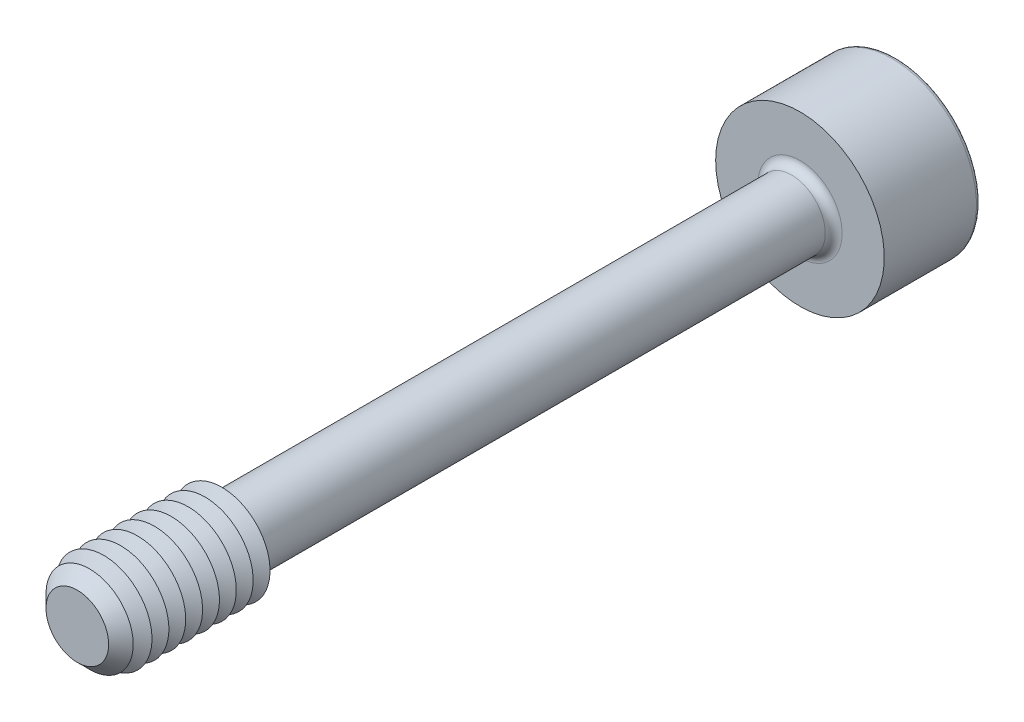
from build123d import *

# Parameters (mm, degrees)
SKETCH1_R       = 1.4
EXTRUDE1_DEPTH  = 15
CHAMFER1_SIZE   = 0.7
SKETCH3_R       = 3.5
EXTRUDE2_DEPTH  = 4
EXTRUDE3_DEPTH  = 3
FILLET1_R       = 0.35
FILLET2_R       = 0.175
LPATTERN1_COUNT = 8
LPATTERN1_PITCH = 0.7


with BuildPart() as part:
    # Sketch1 → Extrude1 (new, symmetric)
    with BuildSketch(Plane.XY):
        Circle(SKETCH1_R)
    extrude(amount=EXTRUDE1_DEPTH, both=True)

    # Sketch2 → Revolve1 (revolve)
    with BuildSketch(Plane(origin=(0, 0, 0), x_dir=(0, 0, -1), z_dir=(1, 0, 0))):
        Polygon((-15, 0), (-15, 2), (-9, 2), (-8.653589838, 1.4), (-8.653589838, 0), align=None)
    revolve(axis=Axis((0, 0, 8.653589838), (0, 0, 1)))

    # Chamfer1
    chamfer1_edges = [part.edges().sort_by_distance(p)[0] for p in [
        (0, -2, 15),
    ]]
    chamfer(chamfer1_edges, length=CHAMFER1_SIZE)

    # Sketch3 → Extrude2 (add)
    with BuildSketch(Plane(origin=(0, 0, -15), x_dir=(-1, 0, 0), z_dir=(0, 0, -1))):
        Circle(SKETCH3_R)
    extrude(amount=EXTRUDE2_DEPTH)

    # Sketch4 → Extrude3 (cut)
    with BuildSketch(Plane(origin=(-13.7, 0, -19), x_dir=(1, 0, 0), z_dir=(0, 0, 1))):
        Polygon((12.833974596, -1.5), (14.566025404, -1.5), (15.432050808, 0), (14.566025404, 1.5), (12.833974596, 1.5), (11.967949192, 0), align=None)
    extrude(amount=EXTRUDE3_DEPTH, mode=Mode.SUBTRACT)

    # Fillet1
    fillet1_edges = [part.edges().sort_by_distance(p)[0] for p in [
        (-1.4, 0, -15),
    ]]
    fillet(fillet1_edges, radius=FILLET1_R)

    # Fillet2
    fillet2_edges = [part.edges().sort_by_distance(p)[0] for p in [
        (3.5, 0, -19),
    ]]
    fillet(fillet2_edges, radius=FILLET2_R)

    # Sketch5 → Cut-Revolve1 (revolve, cut)
    with BuildSketch(Plane(origin=(0, 0, 0), x_dir=(0, 0, -1), z_dir=(1, 0, 0)), mode=Mode.PRIVATE) as cut_revolve1_sk:
        Polygon((16, 0), (16, -1.5), (15.133974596, 0), align=None)
    revolve(cut_revolve1_sk.sketch.rotate(Axis((0, 0, -15.133974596), (0, 0, -1)), 90), axis=Axis((0, 0, -15.133974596), (0, 0, -1)), mode=Mode.SUBTRACT)

    # Sketch7 → Cut-Revolve2 (revolve, cut)
    with BuildSketch(Plane(origin=(0, 0, 0), x_dir=(0, 0, -1), z_dir=(1, 0, 0)), mode=Mode.PRIVATE) as cut_revolve2_sk:
        Polygon((-9, 2), (-9.35, 1.393782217), (-9.7, 2), align=None)
    cut_revolve2 = revolve(cut_revolve2_sk.sketch.rotate(Axis((0, 0, -1.332048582), (0, 0, 1)), 90), axis=Axis((0, 0, -1.332048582), (0, 0, 1)), mode=Mode.SUBTRACT)

    # LPattern1: Cut-Revolve2 ×8
    with Locations(*[(0, 0, i * LPATTERN1_PITCH) for i in range(1, LPATTERN1_COUNT)]):
        add(cut_revolve2, mode=Mode.SUBTRACT)


solid = part.part
